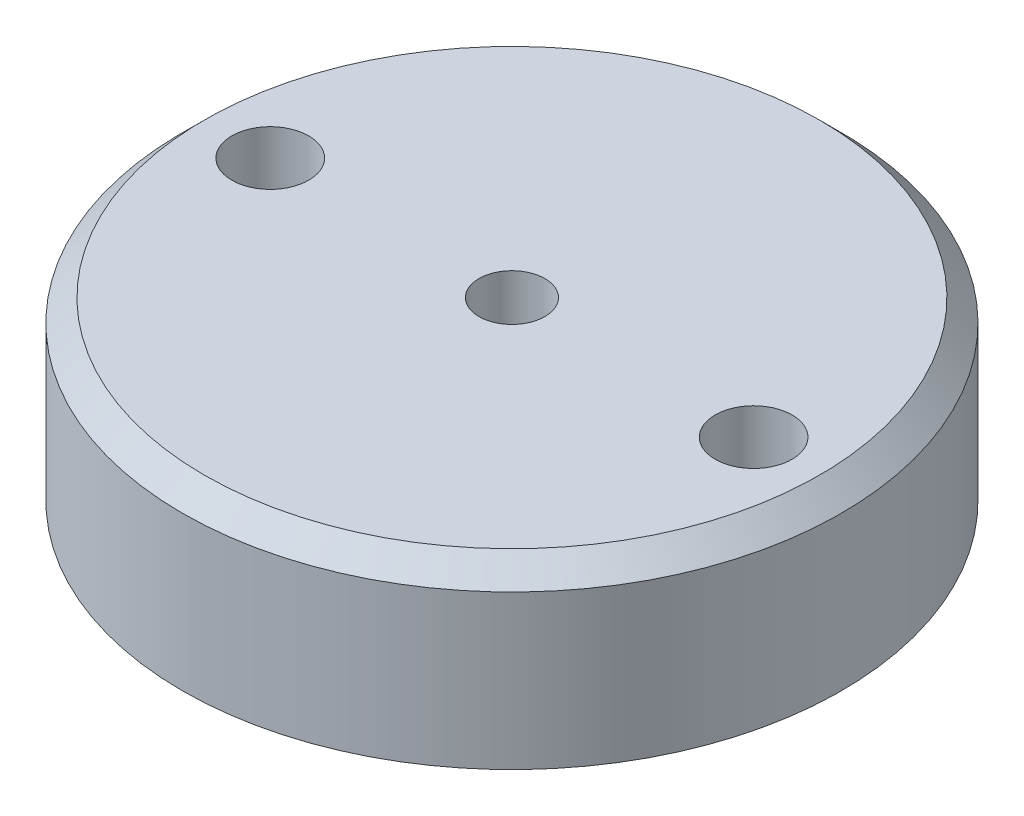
from build123d import *

# Parameters (mm, degrees)
SKETCH1_R          = 15
SKETCH1_R_2        = 1.5
EXTRUDE1_DEPTH     = 8
CHAMFER1_SIZE      = 1
SKETCH2_R          = 1.75
CUT_EXTRUDE1_DEPTH = 23.671568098


with BuildPart() as part:
    # Sketch1 → Extrude1 (new body)
    with BuildSketch(Plane(origin=(0, 0, 0), x_dir=(1, 0, 0), z_dir=(0, 1, 0))):
        with Locations(Location((0, 0, 0), (0, 0, 270))):
            Circle(SKETCH1_R)
        with Locations(Location((0, 0, 0), (0, 0, 270))):
            Circle(SKETCH1_R_2, mode=Mode.SUBTRACT)
    extrude(amount=EXTRUDE1_DEPTH)

    # Chamfer1
    chamfer1_edges = [part.edges().sort_by_distance(p)[0] for p in [
        (0, 8, -15),
    ]]
    chamfer(chamfer1_edges, length=CHAMFER1_SIZE)

    # Sketch2 → Cut-Extrude1 (cut, through all)
    with BuildSketch(Plane(origin=(0, 8, 0), x_dir=(-1, 0, 0), z_dir=(0, 1, 0))):
        with Locations(Location((-11, 0, 0), (0, 0, 90))):
            Circle(SKETCH2_R)
        with Locations(Location((11, 0, 0), (0, 0, 90))):
            Circle(SKETCH2_R)
    extrude(amount=-CUT_EXTRUDE1_DEPTH, mode=Mode.SUBTRACT)


solid = part.part
